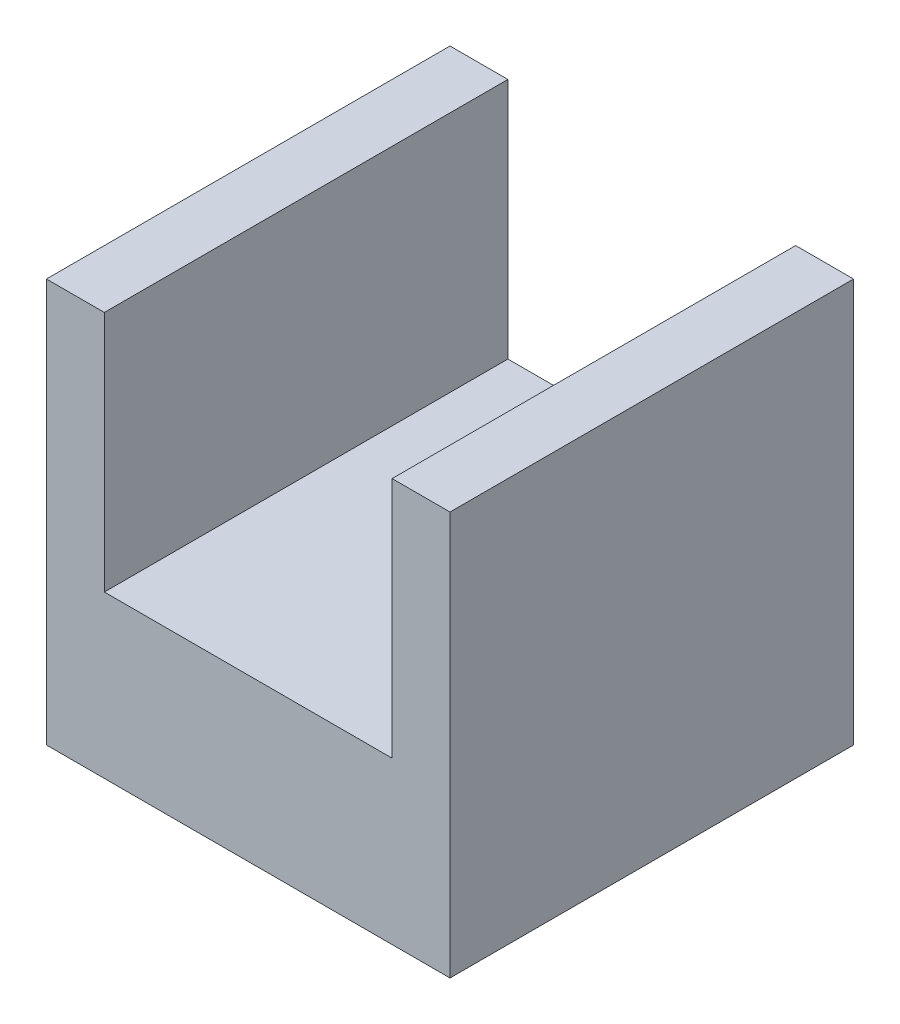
from build123d import *

# Parameters (mm, degrees)
SKETCH1_W           = 40
SKETCH1_H           = 40
BOSS_EXTRUDE1_DEPTH = 40
CUT_EXTRUDE1_REACH  = 50.99
SKETCH2_W           = 28.52
SKETCH2_H           = 24


with BuildPart() as part:
    # Sketch1 → Boss-Extrude1 (new body)
    with BuildSketch(Plane.XY):
        Rectangle(SKETCH1_W, SKETCH1_H)
    extrude(amount=BOSS_EXTRUDE1_DEPTH)

    # Sketch2 → Cut-Extrude1 (cut, up to next)
    with BuildSketch(Plane.XY, mode=Mode.PRIVATE) as cut_extrude1_sk1:
        with Locations((0, 8)):
            Rectangle(SKETCH2_W, SKETCH2_H)
    cut_extrude1_tool1 = extrude(cut_extrude1_sk1.sketch, amount=CUT_EXTRUDE1_REACH, mode=Mode.PRIVATE) & part.part
    add(cut_extrude1_tool1.solids().sort_by_distance((0, 8, 0))[0], mode=Mode.SUBTRACT)


solid = part.part
